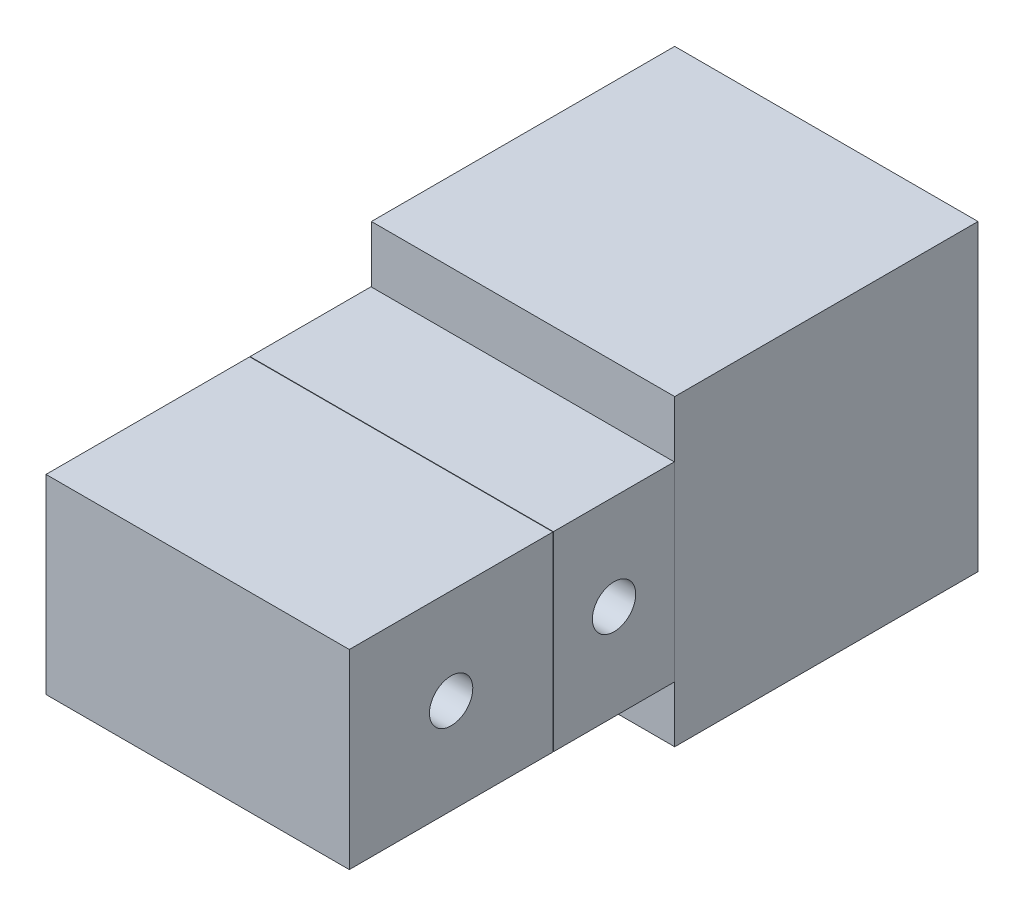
from build123d import *

# Parameters (mm, degrees)
ESQUISSE1_W                = 70
ESQUISSE1_H                = 70
EXTRUSION1_DEPTH           = 70
EXTRUSION2_START           = 0.1
ESQUISSE2_W                = 70
ESQUISSE2_H                = 44
EXTRUSION2_DEPTH           = 27.9
ESQUISSE4_R                = 4
ENL_V_MAT_EXTRU_1_DEPTH    = 30
EXTRUSION3_START           = 0.1
ESQUISSE5_W                = 70
ESQUISSE5_H                = 44
EXTRUSION3_DEPTH           = 47
ESQUISSE6_R                = 5
ENL_V_MAT_EXTRU_2_DEPTH    = 10
ESQUISSE7_R                = 5
ENL_V_MAT_EXTRU_3_DEPTH    = 10
ESQUISSE8_R                = 5
ENL_V_MAT_EXTRU_4_DEPTH    = 165.860577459
ESQUISSE9_R                = 5
ENL_V_MAT_EXTRU_5_DEPTH    = 165.860577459
ESQUISSE10_R               = 2.5
ENL_V_MAT_EXTRU_6_DEPTH    = 10
TROU_TARAUD_M81_AT_2_COUNT = 2
TROU_TARAUD_M81_AT_2_PITCH = 55
TROU_TARAUD_M81_AT_3_COUNT = 2
TROU_TARAUD_M81_AT_3_PITCH = 77.781745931
TROU_TARAUD_M81_AT_4_COUNT = 2
TROU_TARAUD_M81_AT_4_PITCH = 55


with BuildPart() as part:
    # Esquisse1 → Extrusion1 (new body)
    with BuildSketch(Plane.XY):
        Rectangle(ESQUISSE1_W, ESQUISSE1_H)
    extrude(amount=EXTRUSION1_DEPTH)

    # Esquisse4 → Enl_v. mat.-Extru.1 (cut)
    with BuildSketch(Plane(origin=(0, 0, 0), x_dir=(-1, 0, 0), z_dir=(0, 0, -1))):
        with Locations((-19, 17)):
            Circle(ESQUISSE4_R)
        with Locations((19, 17)):
            Circle(ESQUISSE4_R)
        with Locations((19, -17)):
            Circle(ESQUISSE4_R)
        with Locations((-19, -17)):
            Circle(ESQUISSE4_R)
    extrude(amount=-ENL_V_MAT_EXTRU_1_DEPTH, mode=Mode.SUBTRACT)

    # Esquisse6 → Enl_v. mat.-Extru.2 (cut)
    with BuildSketch(Plane(origin=(0, -35, 0), x_dir=(-1, 0, 0), z_dir=(0, 1, 0))):
        with Locations(Location((20, 35, 0), (0, 0, 90))):
            Circle(ESQUISSE6_R)
        with Locations(Location((-20, 35, 0), (0, 0, 90))):
            Circle(ESQUISSE6_R)
    extrude(amount=ENL_V_MAT_EXTRU_2_DEPTH, mode=Mode.SUBTRACT)

    # Esquisse7 → Enl_v. mat.-Extru.3 (cut)
    with BuildSketch(Plane(origin=(-35, 0, 0), x_dir=(0, 0, -1), z_dir=(1, 0, 0))):
        with Locations(Location((-15, 0, 0), (0, 0, 90))):
            Circle(ESQUISSE7_R)
        with Locations(Location((-55, 0, 0), (0, 0, 90))):
            Circle(ESQUISSE7_R)
    extrude(amount=ENL_V_MAT_EXTRU_3_DEPTH, mode=Mode.SUBTRACT)

    # Esquisse10 → Enl_v. mat.-Extru.6 (cut)
    with BuildSketch(Plane(origin=(0, 0, 0), x_dir=(-1, 0, 0), z_dir=(0, 0, -1))):
        with Locations((0, 29)):
            Circle(ESQUISSE10_R)
        with Locations((0, -29)):
            Circle(ESQUISSE10_R)
    extrude(amount=-ENL_V_MAT_EXTRU_6_DEPTH, mode=Mode.SUBTRACT)

    # Esquisse11 → Trou taraud_ M81 (revolve, cut)
    with BuildSketch(Plane(origin=(27.5, -35, 7.5), x_dir=(0, 0, -1), z_dir=(1, 0, 0))):
        Polygon((0, 0), (0, 24.292926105), (3.4, 22.25), (3.4, 1.1), (4.5, 0), align=None)
    trou_taraud_m81 = revolve(axis=Axis((27.5, -41.35, 7.5), (0, 1, 0)), mode=Mode.SUBTRACT)

    # Trou taraud_ M81 at 2: Trou taraud_ M81 ×2
    with Locations(*[(-i * TROU_TARAUD_M81_AT_2_PITCH, 0, 0) for i in range(1, TROU_TARAUD_M81_AT_2_COUNT)]):
        add(trou_taraud_m81, mode=Mode.SUBTRACT)

    # Trou taraud_ M81 at 3: Trou taraud_ M81 ×2
    with Locations(*[Vector(-0.7071067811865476, 0, 0.7071067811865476) * (i * TROU_TARAUD_M81_AT_3_PITCH) for i in range(1, TROU_TARAUD_M81_AT_3_COUNT)]):
        add(trou_taraud_m81, mode=Mode.SUBTRACT)

    # Trou taraud_ M81 at 4: Trou taraud_ M81 ×2
    with Locations(*[(0, 0, i * TROU_TARAUD_M81_AT_4_PITCH) for i in range(1, TROU_TARAUD_M81_AT_4_COUNT)]):
        add(trou_taraud_m81, mode=Mode.SUBTRACT)


with BuildPart() as body_2:
    # Esquisse2 → Extrusion2 (new body)
    with BuildSketch(Plane.XY.offset(70).offset(EXTRUSION2_START)):
        Rectangle(ESQUISSE2_W, ESQUISSE2_H)
    extrude(amount=EXTRUSION2_DEPTH)

    # Esquisse8 → Enl_v. mat.-Extru.4 (cut, through all)
    with BuildSketch(Plane.ZY.offset(35)):
        with Locations(Location((84, 0, 0), (0, 0, 270))):
            Circle(ESQUISSE8_R)
    extrude(amount=-ENL_V_MAT_EXTRU_4_DEPTH, mode=Mode.SUBTRACT)


with BuildPart() as body_3:
    # Esquisse5 → Extrusion3 (new body)
    with BuildSketch(Plane.XY.offset(98).offset(EXTRUSION3_START)):
        Rectangle(ESQUISSE5_W, ESQUISSE5_H)
    extrude(amount=EXTRUSION3_DEPTH)

    # Esquisse9 → Enl_v. mat.-Extru.5 (cut, through all)
    with BuildSketch(Plane.ZY.offset(35)):
        with Locations(Location((121.6, 0, 0), (0, 0, 270))):
            Circle(ESQUISSE9_R)
    extrude(amount=-ENL_V_MAT_EXTRU_5_DEPTH, mode=Mode.SUBTRACT)


solid = Compound([part.part, body_2.part, body_3.part])
